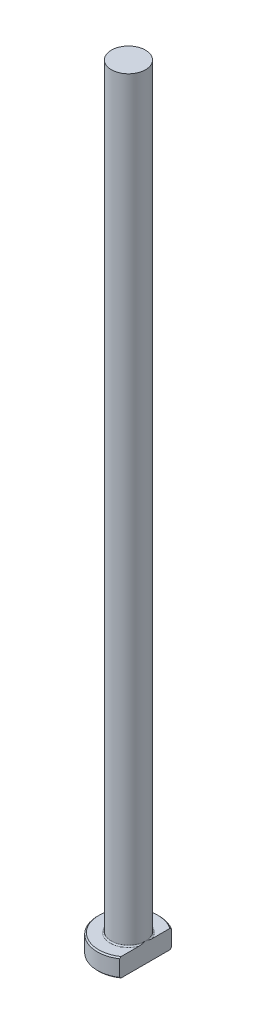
from build123d import *
from build123d.topology import SkipClean

# Parameters (mm, degrees)
CHAMFER1_SIZE = 0.2
FILLET1_R     = 0.2
KEY_DEPTH     = 126.199840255


with BuildPart() as part:
    # Sketch1 → Revolve1 (revolve)
    with BuildSketch(Plane.XY, mode=Mode.PRIVATE) as revolve1_sk:
        Polygon((0, 0), (-5, 0), (-5, 3), (-2.75, 3), (-2.75, 125), (0, 125), align=None)
    revolve(revolve1_sk.sketch.rotate(Axis((0, 259.958771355, 0), (0, -1, 0)), 270), axis=Axis((0, 259.958771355, 0), (0, -1, 0)))

    # Chamfer1
    chamfer1_edges = [part.edges().sort_by_distance(p)[0] for p in [
        (0, 3, -5),
        (0, 0, -5),
    ]]
    chamfer(chamfer1_edges, length=CHAMFER1_SIZE)

    # Fillet1
    fillet1_edges = [part.edges().sort_by_distance(p)[0] for p in [
        (0, 3, -2.75),
    ]]
    fillet(fillet1_edges, radius=FILLET1_R)

    # Sketch2 → KEY (cut, through all)
    with SkipClean():  # the faces are left unmerged after this step: merging them gives an invalid solid
        with BuildSketch(Plane(origin=(0, 0, 0), x_dir=(1, 0, 0), z_dir=(0, 1, 0))):
            with BuildLine():
                Line((2.75, 4.175823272), (2.75, -4.175823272))
                ThreePointArc((2.75, -4.175823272), (5, 0), (2.75, 4.175823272))
            make_face()
        extrude(amount=KEY_DEPTH, mode=Mode.SUBTRACT)


solid = part.part
